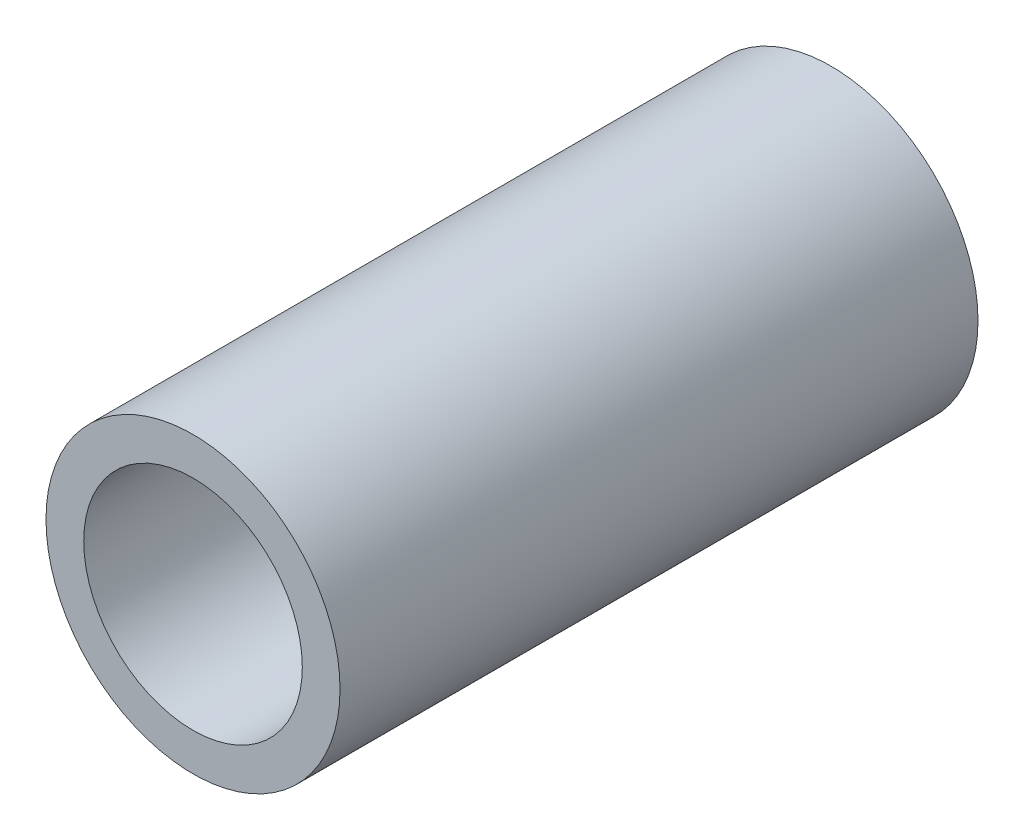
ISO-10303-21;
HEADER;
FILE_DESCRIPTION(('STEP AP214'),'2;1');
FILE_NAME('part.step','',(''),(''),'','','');
FILE_SCHEMA(('AUTOMOTIVE_DESIGN { 1 0 10303 214 1 1 1 1 }'));
ENDSEC;
DATA;
#1=APPLICATION_CONTEXT('core data for automotive mechanical design processes');
#2=APPLICATION_PROTOCOL_DEFINITION('international standard','automotive_design',2000,#1);
#3=PRODUCT_CONTEXT('',#1,'mechanical');
#4=PRODUCT('Part','Part','',(#3));
#5=PRODUCT_RELATED_PRODUCT_CATEGORY('part','',(#4));
#6=PRODUCT_DEFINITION_FORMATION('','',#4);
#7=PRODUCT_DEFINITION_CONTEXT('part definition',#1,'design');
#8=PRODUCT_DEFINITION('design','',#6,#7);
#9=PRODUCT_DEFINITION_SHAPE('','',#8);
#10=(LENGTH_UNIT() NAMED_UNIT(*) SI_UNIT(.MILLI.,.METRE.));
#11=(NAMED_UNIT(*) PLANE_ANGLE_UNIT() SI_UNIT($,.RADIAN.));
#12=(NAMED_UNIT(*) SI_UNIT($,.STERADIAN.) SOLID_ANGLE_UNIT());
#13=UNCERTAINTY_MEASURE_WITH_UNIT(LENGTH_MEASURE(1.E-05),#10,'distance_accuracy_value','');
#14=(GEOMETRIC_REPRESENTATION_CONTEXT(3) GLOBAL_UNCERTAINTY_ASSIGNED_CONTEXT((#13)) GLOBAL_UNIT_ASSIGNED_CONTEXT((#10,
#11,#12)) REPRESENTATION_CONTEXT('',''));
#15=CARTESIAN_POINT('',(0.,0.,0.));
#16=DIRECTION('',(0.,0.,1.));
#17=DIRECTION('',(1.,0.,0.));
#18=AXIS2_PLACEMENT_3D('',#15,#16,#17);
#19=CARTESIAN_POINT('',(0.,0.,29.21));
#20=DIRECTION('',(0.,0.,1.));
#21=DIRECTION('',(1.,0.,0.));
#22=AXIS2_PLACEMENT_3D('',#19,#20,#21);
#23=PLANE('',#22);
#24=CARTESIAN_POINT('',(0.,0.,29.21));
#25=DIRECTION('',(0.,0.,1.));
#26=DIRECTION('',(1.,0.,0.));
#27=AXIS2_PLACEMENT_3D('',#24,#25,#26);
#28=CIRCLE('',#27,6.731);
#29=CARTESIAN_POINT('',(-6.731,0.,29.21));
#30=VERTEX_POINT('',#29);
#31=EDGE_CURVE('E10',#30,#30,#28,.T.);
#32=ORIENTED_EDGE('',*,*,#31,.T.);
#33=EDGE_LOOP('',(#32));
#34=FACE_BOUND('',#33,.T.);
#35=CARTESIAN_POINT('',(0.,0.,29.21));
#36=DIRECTION('',(0.,0.,1.));
#37=DIRECTION('',(1.,0.,0.));
#38=AXIS2_PLACEMENT_3D('',#35,#36,#37);
#39=CIRCLE('',#38,5.0038);
#40=CARTESIAN_POINT('',(-5.0038,0.,29.21));
#41=VERTEX_POINT('',#40);
#42=EDGE_CURVE('E42',#41,#41,#39,.T.);
#43=ORIENTED_EDGE('',*,*,#42,.F.);
#44=EDGE_LOOP('',(#43));
#45=FACE_BOUND('',#44,.T.);
#46=ADVANCED_FACE('F31',(#34,#45),#23,.T.);
#47=CARTESIAN_POINT('',(0.,0.,0.));
#48=DIRECTION('',(0.,0.,1.));
#49=DIRECTION('',(1.,0.,0.));
#50=AXIS2_PLACEMENT_3D('',#47,#48,#49);
#51=PLANE('',#50);
#52=CARTESIAN_POINT('',(0.,0.,0.));
#53=DIRECTION('',(0.,0.,1.));
#54=DIRECTION('',(1.,0.,0.));
#55=AXIS2_PLACEMENT_3D('',#52,#53,#54);
#56=CIRCLE('',#55,6.731);
#57=CARTESIAN_POINT('',(-6.731,0.,0.));
#58=VERTEX_POINT('',#57);
#59=EDGE_CURVE('E35',#58,#58,#56,.T.);
#60=ORIENTED_EDGE('',*,*,#59,.F.);
#61=EDGE_LOOP('',(#60));
#62=FACE_BOUND('',#61,.T.);
#63=CARTESIAN_POINT('',(0.,0.,0.));
#64=DIRECTION('',(0.,0.,1.));
#65=DIRECTION('',(1.,0.,0.));
#66=AXIS2_PLACEMENT_3D('',#63,#64,#65);
#67=CIRCLE('',#66,5.0038);
#68=CARTESIAN_POINT('',(-5.0038,0.,0.));
#69=VERTEX_POINT('',#68);
#70=EDGE_CURVE('E44',#69,#69,#67,.T.);
#71=ORIENTED_EDGE('',*,*,#70,.T.);
#72=EDGE_LOOP('',(#71));
#73=FACE_BOUND('',#72,.T.);
#74=ADVANCED_FACE('F54',(#62,#73),#51,.F.);
#75=CARTESIAN_POINT('',(0.,0.,29.21));
#76=DIRECTION('',(0.,0.,-1.));
#77=DIRECTION('',(-1.,0.,0.));
#78=AXIS2_PLACEMENT_3D('',#75,#76,#77);
#79=CYLINDRICAL_SURFACE('',#78,6.731);
#80=CARTESIAN_POINT('',(-6.731,0.,29.21));
#81=CARTESIAN_POINT('',(-6.731,0.,28.9057291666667));
#82=CARTESIAN_POINT('',(-6.731,0.,28.6014583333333));
#83=CARTESIAN_POINT('',(-6.731,0.,27.9929166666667));
#84=CARTESIAN_POINT('',(-6.731,0.,27.6886458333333));
#85=CARTESIAN_POINT('',(-6.731,0.,27.0801041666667));
#86=CARTESIAN_POINT('',(-6.731,0.,26.7758333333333));
#87=CARTESIAN_POINT('',(-6.731,0.,26.1672916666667));
#88=CARTESIAN_POINT('',(-6.731,0.,25.8630208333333));
#89=CARTESIAN_POINT('',(-6.731,0.,25.2544791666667));
#90=CARTESIAN_POINT('',(-6.731,0.,24.9502083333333));
#91=CARTESIAN_POINT('',(-6.731,0.,24.3416666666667));
#92=CARTESIAN_POINT('',(-6.731,0.,24.0373958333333));
#93=CARTESIAN_POINT('',(-6.731,0.,23.4288541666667));
#94=CARTESIAN_POINT('',(-6.731,0.,23.1245833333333));
#95=CARTESIAN_POINT('',(-6.731,0.,22.5160416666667));
#96=CARTESIAN_POINT('',(-6.731,0.,22.2117708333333));
#97=CARTESIAN_POINT('',(-6.731,0.,21.6032291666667));
#98=CARTESIAN_POINT('',(-6.731,0.,21.2989583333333));
#99=CARTESIAN_POINT('',(-6.731,0.,20.6904166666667));
#100=CARTESIAN_POINT('',(-6.731,0.,20.3861458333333));
#101=CARTESIAN_POINT('',(-6.731,0.,19.7776041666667));
#102=CARTESIAN_POINT('',(-6.731,0.,19.4733333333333));
#103=CARTESIAN_POINT('',(-6.731,0.,18.8647916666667));
#104=CARTESIAN_POINT('',(-6.731,0.,18.5605208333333));
#105=CARTESIAN_POINT('',(-6.731,0.,17.9519791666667));
#106=CARTESIAN_POINT('',(-6.731,0.,17.6477083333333));
#107=CARTESIAN_POINT('',(-6.731,0.,17.0391666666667));
#108=CARTESIAN_POINT('',(-6.731,0.,16.7348958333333));
#109=CARTESIAN_POINT('',(-6.731,0.,16.1263541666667));
#110=CARTESIAN_POINT('',(-6.731,0.,15.8220833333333));
#111=CARTESIAN_POINT('',(-6.731,0.,15.2135416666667));
#112=CARTESIAN_POINT('',(-6.731,0.,14.9092708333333));
#113=CARTESIAN_POINT('',(-6.731,0.,14.3007291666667));
#114=CARTESIAN_POINT('',(-6.731,0.,13.9964583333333));
#115=CARTESIAN_POINT('',(-6.731,0.,13.3879166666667));
#116=CARTESIAN_POINT('',(-6.731,0.,13.0836458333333));
#117=CARTESIAN_POINT('',(-6.731,0.,12.4751041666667));
#118=CARTESIAN_POINT('',(-6.731,0.,12.1708333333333));
#119=CARTESIAN_POINT('',(-6.731,0.,11.5622916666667));
#120=CARTESIAN_POINT('',(-6.731,0.,11.2580208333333));
#121=CARTESIAN_POINT('',(-6.731,0.,10.6494791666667));
#122=CARTESIAN_POINT('',(-6.731,0.,10.3452083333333));
#123=CARTESIAN_POINT('',(-6.731,0.,9.73666666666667));
#124=CARTESIAN_POINT('',(-6.731,0.,9.43239583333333));
#125=CARTESIAN_POINT('',(-6.731,0.,8.82385416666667));
#126=CARTESIAN_POINT('',(-6.731,0.,8.51958333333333));
#127=CARTESIAN_POINT('',(-6.731,0.,7.91104166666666));
#128=CARTESIAN_POINT('',(-6.731,0.,7.60677083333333));
#129=CARTESIAN_POINT('',(-6.731,0.,6.99822916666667));
#130=CARTESIAN_POINT('',(-6.731,0.,6.69395833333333));
#131=CARTESIAN_POINT('',(-6.731,0.,6.08541666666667));
#132=CARTESIAN_POINT('',(-6.731,0.,5.78114583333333));
#133=CARTESIAN_POINT('',(-6.731,0.,5.17260416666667));
#134=CARTESIAN_POINT('',(-6.731,0.,4.86833333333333));
#135=CARTESIAN_POINT('',(-6.731,0.,4.25979166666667));
#136=CARTESIAN_POINT('',(-6.731,0.,3.95552083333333));
#137=CARTESIAN_POINT('',(-6.731,0.,3.34697916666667));
#138=CARTESIAN_POINT('',(-6.731,0.,3.04270833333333));
#139=CARTESIAN_POINT('',(-6.731,0.,2.43416666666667));
#140=CARTESIAN_POINT('',(-6.731,0.,2.12989583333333));
#141=CARTESIAN_POINT('',(-6.731,0.,1.52135416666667));
#142=CARTESIAN_POINT('',(-6.731,0.,1.21708333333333));
#143=CARTESIAN_POINT('',(-6.731,0.,0.608541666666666));
#144=CARTESIAN_POINT('',(-6.731,0.,0.304270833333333));
#145=CARTESIAN_POINT('',(-6.731,0.,0.));
#146=B_SPLINE_CURVE_WITH_KNOTS('',3,(#80,#81,#82,#83,#84,#85,#86,#87,#88,#89,#90,#91,#92,#93,
#94,#95,#96,#97,#98,#99,#100,#101,#102,#103,#104,#105,#106,#107,#108,#109,#110,#111,#112,#113,
#114,#115,#116,#117,#118,#119,#120,#121,#122,#123,#124,#125,#126,#127,#128,#129,#130,#131,#132,
#133,#134,#135,#136,#137,#138,#139,#140,#141,#142,#143,#144,#145),.UNSPECIFIED.,.F.,.F.,(4,2,2,
2,2,2,2,2,2,2,2,2,2,2,2,2,2,2,2,2,2,2,2,2,2,2,2,2,2,2,2,2,4),(0.,0.912812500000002,1.825625,
2.7384375,3.65125,4.5640625,5.476875,6.3896875,7.3025,8.2153125,9.128125,10.0409375,10.95375,
11.8665625,12.779375,13.6921875,14.605,15.5178125,16.430625,17.3434375,18.25625,19.1690625,
20.081875,20.9946875,21.9075,22.8203125,23.733125,24.6459375,25.55875,26.4715625,27.384375,
28.2971875,29.21),.UNSPECIFIED.);
#147=EDGE_CURVE('BSEAM33',#30,#58,#146,.T.);
#148=ORIENTED_EDGE('',*,*,#31,.F.);
#149=ORIENTED_EDGE('',*,*,#59,.T.);
#150=ORIENTED_EDGE('',*,*,#147,.T.);
#151=ORIENTED_EDGE('',*,*,#147,.F.);
#152=EDGE_LOOP('',(#148,#150,#149,#151));
#153=FACE_BOUND('',#152,.T.);
#154=ADVANCED_FACE('F33',(#153),#79,.T.);
#155=CARTESIAN_POINT('',(0.,0.,29.21));
#156=DIRECTION('',(0.,0.,-1.));
#157=DIRECTION('',(-1.,0.,0.));
#158=AXIS2_PLACEMENT_3D('',#155,#156,#157);
#159=CYLINDRICAL_SURFACE('',#158,5.0038);
#160=CARTESIAN_POINT('',(-5.0038,0.,29.21));
#161=CARTESIAN_POINT('',(-5.0038,0.,28.9057291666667));
#162=CARTESIAN_POINT('',(-5.0038,0.,28.6014583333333));
#163=CARTESIAN_POINT('',(-5.0038,0.,27.9929166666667));
#164=CARTESIAN_POINT('',(-5.0038,0.,27.6886458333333));
#165=CARTESIAN_POINT('',(-5.0038,0.,27.0801041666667));
#166=CARTESIAN_POINT('',(-5.0038,0.,26.7758333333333));
#167=CARTESIAN_POINT('',(-5.0038,0.,26.1672916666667));
#168=CARTESIAN_POINT('',(-5.0038,0.,25.8630208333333));
#169=CARTESIAN_POINT('',(-5.0038,0.,25.2544791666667));
#170=CARTESIAN_POINT('',(-5.0038,0.,24.9502083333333));
#171=CARTESIAN_POINT('',(-5.0038,0.,24.3416666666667));
#172=CARTESIAN_POINT('',(-5.0038,0.,24.0373958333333));
#173=CARTESIAN_POINT('',(-5.0038,0.,23.4288541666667));
#174=CARTESIAN_POINT('',(-5.0038,0.,23.1245833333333));
#175=CARTESIAN_POINT('',(-5.0038,0.,22.5160416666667));
#176=CARTESIAN_POINT('',(-5.0038,0.,22.2117708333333));
#177=CARTESIAN_POINT('',(-5.0038,0.,21.6032291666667));
#178=CARTESIAN_POINT('',(-5.0038,0.,21.2989583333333));
#179=CARTESIAN_POINT('',(-5.0038,0.,20.6904166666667));
#180=CARTESIAN_POINT('',(-5.0038,0.,20.3861458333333));
#181=CARTESIAN_POINT('',(-5.0038,0.,19.7776041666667));
#182=CARTESIAN_POINT('',(-5.0038,0.,19.4733333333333));
#183=CARTESIAN_POINT('',(-5.0038,0.,18.8647916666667));
#184=CARTESIAN_POINT('',(-5.0038,0.,18.5605208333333));
#185=CARTESIAN_POINT('',(-5.0038,0.,17.9519791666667));
#186=CARTESIAN_POINT('',(-5.0038,0.,17.6477083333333));
#187=CARTESIAN_POINT('',(-5.0038,0.,17.0391666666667));
#188=CARTESIAN_POINT('',(-5.0038,0.,16.7348958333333));
#189=CARTESIAN_POINT('',(-5.0038,0.,16.1263541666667));
#190=CARTESIAN_POINT('',(-5.0038,0.,15.8220833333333));
#191=CARTESIAN_POINT('',(-5.0038,0.,15.2135416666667));
#192=CARTESIAN_POINT('',(-5.0038,0.,14.9092708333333));
#193=CARTESIAN_POINT('',(-5.0038,0.,14.3007291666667));
#194=CARTESIAN_POINT('',(-5.0038,0.,13.9964583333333));
#195=CARTESIAN_POINT('',(-5.0038,0.,13.3879166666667));
#196=CARTESIAN_POINT('',(-5.0038,0.,13.0836458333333));
#197=CARTESIAN_POINT('',(-5.0038,0.,12.4751041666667));
#198=CARTESIAN_POINT('',(-5.0038,0.,12.1708333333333));
#199=CARTESIAN_POINT('',(-5.0038,0.,11.5622916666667));
#200=CARTESIAN_POINT('',(-5.0038,0.,11.2580208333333));
#201=CARTESIAN_POINT('',(-5.0038,0.,10.6494791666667));
#202=CARTESIAN_POINT('',(-5.0038,0.,10.3452083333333));
#203=CARTESIAN_POINT('',(-5.0038,0.,9.73666666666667));
#204=CARTESIAN_POINT('',(-5.0038,0.,9.43239583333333));
#205=CARTESIAN_POINT('',(-5.0038,0.,8.82385416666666));
#206=CARTESIAN_POINT('',(-5.0038,0.,8.51958333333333));
#207=CARTESIAN_POINT('',(-5.0038,0.,7.91104166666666));
#208=CARTESIAN_POINT('',(-5.0038,0.,7.60677083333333));
#209=CARTESIAN_POINT('',(-5.0038,0.,6.99822916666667));
#210=CARTESIAN_POINT('',(-5.0038,0.,6.69395833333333));
#211=CARTESIAN_POINT('',(-5.0038,0.,6.08541666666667));
#212=CARTESIAN_POINT('',(-5.0038,0.,5.78114583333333));
#213=CARTESIAN_POINT('',(-5.0038,0.,5.17260416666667));
#214=CARTESIAN_POINT('',(-5.0038,0.,4.86833333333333));
#215=CARTESIAN_POINT('',(-5.0038,0.,4.25979166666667));
#216=CARTESIAN_POINT('',(-5.0038,0.,3.95552083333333));
#217=CARTESIAN_POINT('',(-5.0038,0.,3.34697916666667));
#218=CARTESIAN_POINT('',(-5.0038,0.,3.04270833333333));
#219=CARTESIAN_POINT('',(-5.0038,0.,2.43416666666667));
#220=CARTESIAN_POINT('',(-5.0038,0.,2.12989583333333));
#221=CARTESIAN_POINT('',(-5.0038,0.,1.52135416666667));
#222=CARTESIAN_POINT('',(-5.0038,0.,1.21708333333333));
#223=CARTESIAN_POINT('',(-5.0038,0.,0.608541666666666));
#224=CARTESIAN_POINT('',(-5.0038,0.,0.304270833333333));
#225=CARTESIAN_POINT('',(-5.0038,0.,0.));
#226=B_SPLINE_CURVE_WITH_KNOTS('',3,(#160,#161,#162,#163,#164,#165,#166,#167,#168,#169,#170,
#171,#172,#173,#174,#175,#176,#177,#178,#179,#180,#181,#182,#183,#184,#185,#186,#187,#188,#189,
#190,#191,#192,#193,#194,#195,#196,#197,#198,#199,#200,#201,#202,#203,#204,#205,#206,#207,#208,
#209,#210,#211,#212,#213,#214,#215,#216,#217,#218,#219,#220,#221,#222,#223,#224,#225),
.UNSPECIFIED.,.F.,.F.,(4,2,2,2,2,2,2,2,2,2,2,2,2,2,2,2,2,2,2,2,2,2,2,2,2,2,2,2,2,2,2,2,4),(0.,
0.912812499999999,1.825625,2.7384375,3.65125,4.5640625,5.476875,6.3896875,7.3025,8.2153125,
9.12812499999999,10.0409375,10.95375,11.8665625,12.779375,13.6921875,14.605,15.5178125,
16.430625,17.3434375,18.25625,19.1690625,20.081875,20.9946875,21.9075,22.8203125,23.733125,
24.6459375,25.55875,26.4715625,27.384375,28.2971875,29.21),.UNSPECIFIED.);
#227=EDGE_CURVE('BSEAM50',#41,#69,#226,.T.);
#228=ORIENTED_EDGE('',*,*,#42,.T.);
#229=ORIENTED_EDGE('',*,*,#70,.F.);
#230=ORIENTED_EDGE('',*,*,#227,.T.);
#231=ORIENTED_EDGE('',*,*,#227,.F.);
#232=EDGE_LOOP('',(#228,#230,#229,#231));
#233=FACE_BOUND('',#232,.T.);
#234=ADVANCED_FACE('F50',(#233),#159,.F.);
#235=CLOSED_SHELL('',(#46,#74,#154,#234));
#236=MANIFOLD_SOLID_BREP('B2',#235);
#237=ADVANCED_BREP_SHAPE_REPRESENTATION('',(#18,#236),#14);
#238=SHAPE_DEFINITION_REPRESENTATION(#9,#237);
ENDSEC;
END-ISO-10303-21;
